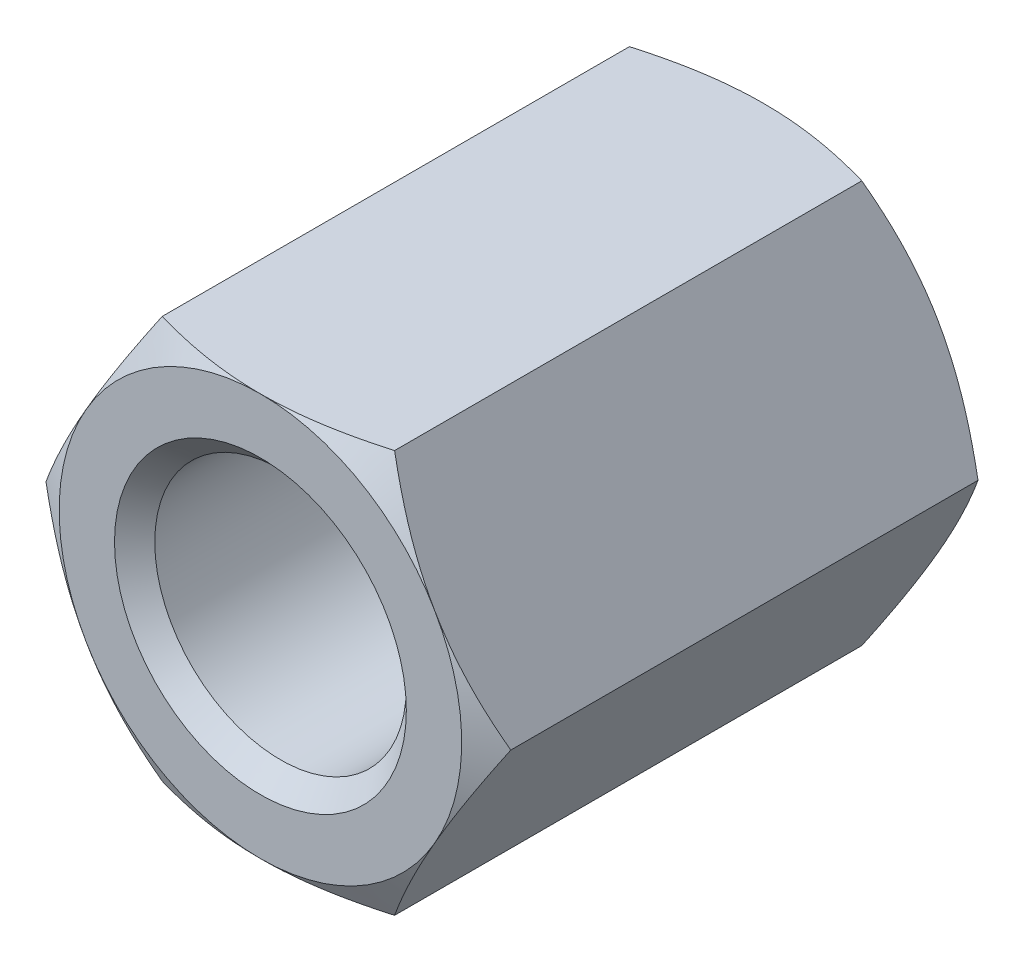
from build123d import *

# Parameters (mm, degrees)
BOSS_EXTRUDE1_DEPTH      = 5
SKETCH2_OUTSIDE_W        = 44.692
SKETCH2_OUTSIDE_H        = 43.454
SKETCH2_OUTSIDE_R        = 4
CUT_EXTRUDE1_DEPTH       = 8.895146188
CUT_EXTRUDE1_DRAFT       = -60
SKETCH3_R                = 2.5
SKETCH3_R_2              = 2.1
CUT_EXTRUDE2_DEPTH       = 5
SKETCH3_2_R              = 2.1
CUT_EXTRUDE3_DEPTH       = 6.2
CHAMFER1_SIZE            = 0.4
MIRROR1_COPY_1_SKETCH_W  = 44.692
MIRROR1_COPY_1_SKETCH_H  = 43.454
MIRROR1_COPY_1_SKETCH_R  = 4
MIRROR1_COPY_1_DEPTH     = 8.895146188
MIRROR1_COPY_1_DRAFT     = -60
CHAMFER1_OF_MIRROR1_SIZE = 0.4


with BuildPart() as part:
    # Sketch1 → Boss-Extrude1 (new body)
    with BuildSketch(Plane.XY):
        Polygon((2.309401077, 4), (-2.309401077, 4), (-4.618802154, 0), (-2.309401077, -4), (2.309401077, -4), (4.618802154, 0), align=None)
    boss_extrude1 = extrude(amount=-BOSS_EXTRUDE1_DEPTH)


with BuildPart() as cut_extrude1_tool:
    # Sketch2 outside → Cut-Extrude1 (with draft: the straight prism first)
    with BuildSketch(Plane(origin=(0, 0, -5), x_dir=(-1, 0, 0), z_dir=(0, 0, -1))):
        Rectangle(SKETCH2_OUTSIDE_W, SKETCH2_OUTSIDE_H)
        Circle(SKETCH2_OUTSIDE_R, mode=Mode.SUBTRACT)
    extrude(amount=-CUT_EXTRUDE1_DEPTH)
    # Cut-Extrude1: the draft: its side faces are tilted about the plane it starts from
    cut_extrude1_sides = [cut_extrude1_tool.faces().sort_by_distance(p)[0] for p in [
        (0, -21.727, -0.552426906),
        (-22.346, 0, -0.552426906),
        (0, 21.727, -0.552426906),
        (22.346, 0, -0.552426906),
        (4, 0, -0.552426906),
    ]]
    draft(cut_extrude1_sides, Plane(origin=(0, 0, -5), x_dir=(-1, 0, 0), z_dir=(0, 0, -1)), CUT_EXTRUDE1_DRAFT)


with BuildPart() as part_1:
    add(part.part)

    # Cut-Extrude1: cut by cut_extrude1_tool
    add(cut_extrude1_tool.part, mode=Mode.SUBTRACT)

    # Sketch3 → Cut-Extrude2 (cut)
    with BuildSketch(Plane(origin=(0, 0, -5), x_dir=(-1, 0, 0), z_dir=(0, 0, -1))):
        Circle(SKETCH3_R)
        Circle(SKETCH3_R_2, mode=Mode.SUBTRACT)
    cut_extrude2 = extrude(amount=-CUT_EXTRUDE2_DEPTH, mode=Mode.SUBTRACT)


with BuildPart() as cut_extrude2_piece_1:
    # of the separate pieces the step leaves, piece 1, a body of its own (cut_extrude2_pieces)
    add(part_1.part.solids().sort_by_distance((2.309401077, 4, 0))[0])

    # Chamfer1
    chamfer1_edges = [cut_extrude2_piece_1.edges().sort_by_distance(p)[0] for p in [
        (2.5, 0, -5),
    ]]
    chamfer(chamfer1_edges, length=CHAMFER1_SIZE)


with BuildPart() as cut_extrude2_piece_2:
    # of the separate pieces the step leaves, piece 2, a body of its own (cut_extrude2_pieces)
    add(part_1.part.solids().sort_by_distance((-2.1, 0, 0))[0])

    # Sketch3_2 → Cut-Extrude3 (cut)
    with BuildSketch(Plane(origin=(0, 0, -5), x_dir=(-1, 0, 0), z_dir=(0, 0, -1))):
        Circle(SKETCH3_2_R)
    cut_extrude3 = extrude(amount=-CUT_EXTRUDE3_DEPTH, mode=Mode.SUBTRACT)


with BuildPart() as cut_extrude2_piece_1_1:
    add(cut_extrude2_piece_1.part)

    # Mirror1: Boss-Extrude1, Cut-Extrude2, Cut-Extrude3 across plane
    add(boss_extrude1.mirror(Plane.XY))
    add(cut_extrude2.mirror(Plane.XY), mode=Mode.SUBTRACT)
    add(cut_extrude3.mirror(Plane.XY), mode=Mode.SUBTRACT)


with BuildPart() as mirror1_copy_1_tool:
    # Mirror1 copy 1 sketch → Mirror1 copy 1 (with draft: the straight prism first)
    with BuildSketch(Plane(origin=(0, 0, 5), x_dir=(-1, 0, 0), z_dir=(0, 0, 1))):
        Rectangle(MIRROR1_COPY_1_SKETCH_W, MIRROR1_COPY_1_SKETCH_H)
        Circle(MIRROR1_COPY_1_SKETCH_R, mode=Mode.SUBTRACT)
    extrude(amount=-MIRROR1_COPY_1_DEPTH)
    # Mirror1 copy 1: the draft: its side faces are tilted about the plane it starts from
    mirror1_copy_1_sides = [mirror1_copy_1_tool.faces().sort_by_distance(p)[0] for p in [
        (0, -21.727, 0.552426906),
        (-22.346, 0, 0.552426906),
        (0, 21.727, 0.552426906),
        (22.346, 0, 0.552426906),
        (4, 0, 0.552426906),
    ]]
    draft(mirror1_copy_1_sides, Plane(origin=(0, 0, 5), x_dir=(-1, 0, 0), z_dir=(0, 0, 1)), MIRROR1_COPY_1_DRAFT)


with BuildPart() as cut_extrude2_piece_1_2:
    add(cut_extrude2_piece_1_1.part)

    # Mirror1 copy 1: cut by mirror1_copy_1_tool
    add(mirror1_copy_1_tool.part, mode=Mode.SUBTRACT)

    # Chamfer1 of Mirror1
    chamfer1_of_mirror1_edges = [cut_extrude2_piece_1_2.edges().sort_by_distance(p)[0] for p in [
        (2.5, 0, 5),
    ]]
    chamfer(chamfer1_of_mirror1_edges, length=CHAMFER1_OF_MIRROR1_SIZE)


solid = cut_extrude2_piece_1_2.part
